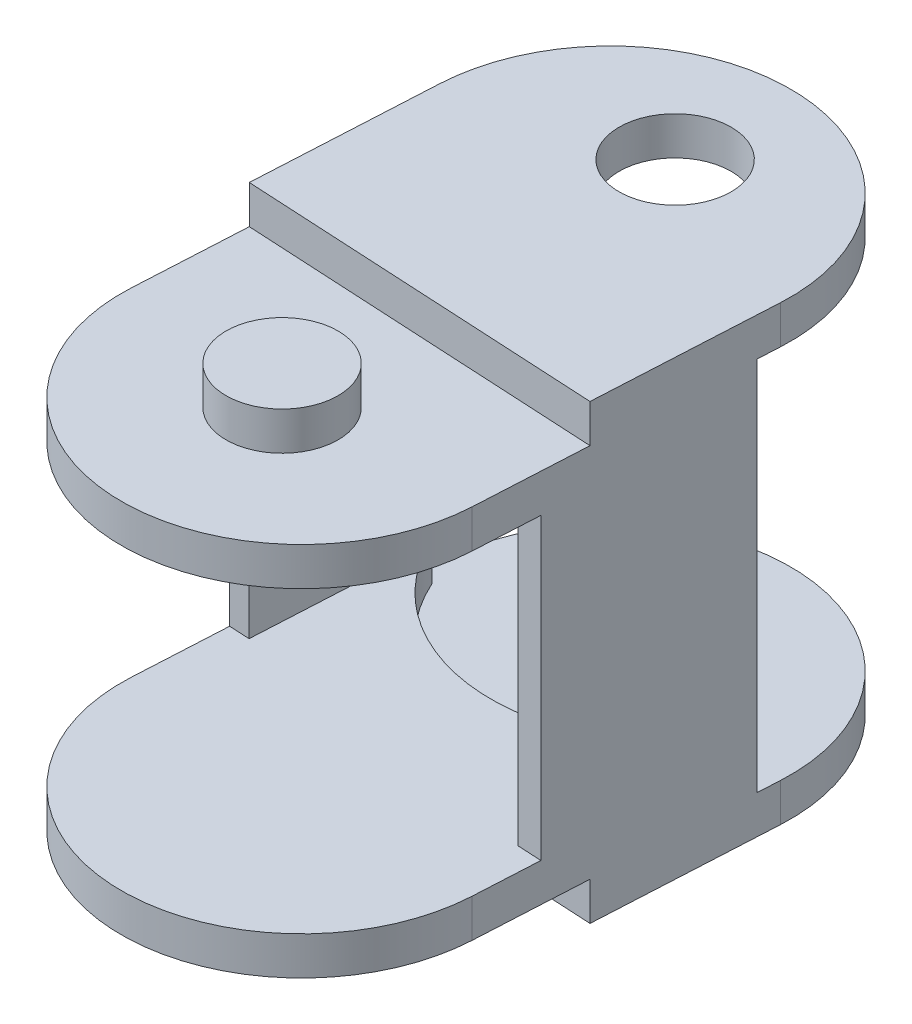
ISO-10303-21;
HEADER;
FILE_DESCRIPTION(('STEP AP214'),'2;1');
FILE_NAME('part.step','',(''),(''),'','','');
FILE_SCHEMA(('AUTOMOTIVE_DESIGN { 1 0 10303 214 1 1 1 1 }'));
ENDSEC;
DATA;
#1=APPLICATION_CONTEXT('core data for automotive mechanical design processes');
#2=APPLICATION_PROTOCOL_DEFINITION('international standard','automotive_design',2000,#1);
#3=PRODUCT_CONTEXT('',#1,'mechanical');
#4=PRODUCT('Part','Part','',(#3));
#5=PRODUCT_RELATED_PRODUCT_CATEGORY('part','',(#4));
#6=PRODUCT_DEFINITION_FORMATION('','',#4);
#7=PRODUCT_DEFINITION_CONTEXT('part definition',#1,'design');
#8=PRODUCT_DEFINITION('design','',#6,#7);
#9=PRODUCT_DEFINITION_SHAPE('','',#8);
#10=(LENGTH_UNIT() NAMED_UNIT(*) SI_UNIT(.MILLI.,.METRE.));
#11=(NAMED_UNIT(*) PLANE_ANGLE_UNIT() SI_UNIT($,.RADIAN.));
#12=(NAMED_UNIT(*) SI_UNIT($,.STERADIAN.) SOLID_ANGLE_UNIT());
#13=UNCERTAINTY_MEASURE_WITH_UNIT(LENGTH_MEASURE(1.E-05),#10,'distance_accuracy_value','');
#14=(GEOMETRIC_REPRESENTATION_CONTEXT(3) GLOBAL_UNCERTAINTY_ASSIGNED_CONTEXT((#13)) GLOBAL_UNIT_ASSIGNED_CONTEXT((#10,
#11,#12)) REPRESENTATION_CONTEXT('',''));
#15=CARTESIAN_POINT('',(0.,0.,0.));
#16=DIRECTION('',(0.,0.,1.));
#17=DIRECTION('',(1.,0.,0.));
#18=AXIS2_PLACEMENT_3D('',#15,#16,#17);
#19=CARTESIAN_POINT('',(-563.634774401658,6.,25.7427792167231));
#20=DIRECTION('',(0.,-1.,0.));
#21=DIRECTION('',(0.,0.,-1.));
#22=AXIS2_PLACEMENT_3D('',#19,#20,#21);
#23=PLANE('',#22);
#24=DIRECTION('',(-0.0534947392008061,0.,0.998568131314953));
#25=VECTOR('',#24,1.);
#26=CARTESIAN_POINT('',(-563.085561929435,6.,25.7722013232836));
#27=LINE('',#26,#25);
#28=CARTESIAN_POINT('',(-563.299540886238,6.,29.7664738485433));
#29=VERTEX_POINT('',#28);
#30=CARTESIAN_POINT('',(-562.871582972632,6.,21.7779287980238));
#31=VERTEX_POINT('',#30);
#32=EDGE_CURVE('E313',#29,#31,#27,.F.);
#33=ORIENTED_EDGE('',*,*,#32,.T.);
#34=DIRECTION('',(0.998568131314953,0.,0.0534947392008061));
#35=VECTOR('',#34,1.);
#36=CARTESIAN_POINT('',(-563.420795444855,6.,21.7485066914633));
#37=LINE('',#36,#35);
#38=CARTESIAN_POINT('',(-563.970007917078,6.,21.7190845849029));
#39=VERTEX_POINT('',#38);
#40=EDGE_CURVE('E291',#31,#39,#37,.F.);
#41=ORIENTED_EDGE('',*,*,#40,.T.);
#42=DIRECTION('',(-0.0534947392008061,0.,0.998568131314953));
#43=VECTOR('',#42,1.);
#44=CARTESIAN_POINT('',(-564.245505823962,6.,26.8617104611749));
#45=LINE('',#44,#43);
#46=CARTESIAN_POINT('',(-564.397965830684,6.,29.7076296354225));
#47=VERTEX_POINT('',#46);
#48=EDGE_CURVE('E238',#47,#39,#45,.F.);
#49=ORIENTED_EDGE('',*,*,#48,.F.);
#50=DIRECTION('',(-0.998568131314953,0.,-0.0534947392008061));
#51=VECTOR('',#50,1.);
#52=CARTESIAN_POINT('',(-563.848753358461,6.,29.7370517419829));
#53=LINE('',#52,#51);
#54=EDGE_CURVE('E262',#47,#29,#53,.F.);
#55=ORIENTED_EDGE('',*,*,#54,.T.);
#56=EDGE_LOOP('',(#33,#41,#49,#55));
#57=FACE_BOUND('',#56,.T.);
#58=ADVANCED_FACE('F17',(#57),#23,.F.);
#59=CARTESIAN_POINT('',(-563.420795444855,8.,21.7485066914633));
#60=DIRECTION('',(-0.0534947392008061,0.,0.998568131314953));
#61=DIRECTION('',(0.998568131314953,0.,0.0534947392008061));
#62=AXIS2_PLACEMENT_3D('',#59,#60,#61);
#63=PLANE('',#62);
#64=DIRECTION('',(0.,1.,0.));
#65=VECTOR('',#64,1.);
#66=CARTESIAN_POINT('',(-562.871582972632,8.,21.7779287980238));
#67=LINE('',#66,#65);
#68=CARTESIAN_POINT('',(-562.871582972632,0.,21.7779287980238));
#69=VERTEX_POINT('',#68);
#70=EDGE_CURVE('E314',#31,#69,#67,.F.);
#71=ORIENTED_EDGE('',*,*,#70,.T.);
#72=DIRECTION('',(0.998568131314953,0.,0.0534947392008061));
#73=VECTOR('',#72,1.);
#74=CARTESIAN_POINT('',(-563.420795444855,0.,21.7485066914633));
#75=LINE('',#74,#73);
#76=CARTESIAN_POINT('',(-563.970007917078,0.,21.7190845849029));
#77=VERTEX_POINT('',#76);
#78=EDGE_CURVE('E301',#77,#69,#75,.T.);
#79=ORIENTED_EDGE('',*,*,#78,.F.);
#80=DIRECTION('',(0.,1.,0.));
#81=VECTOR('',#80,1.);
#82=CARTESIAN_POINT('',(-563.970007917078,20.1,21.7190845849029));
#83=LINE('',#82,#81);
#84=EDGE_CURVE('E282',#39,#77,#83,.F.);
#85=ORIENTED_EDGE('',*,*,#84,.F.);
#86=ORIENTED_EDGE('',*,*,#40,.F.);
#87=EDGE_LOOP('',(#71,#79,#85,#86));
#88=FACE_BOUND('',#87,.T.);
#89=ADVANCED_FACE('F925',(#88),#63,.F.);
#90=CARTESIAN_POINT('',(-554.253583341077,8.,20.7374566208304));
#91=DIRECTION('',(0.0534947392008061,0.,-0.998568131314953));
#92=DIRECTION('',(-0.998568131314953,0.,-0.0534947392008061));
#93=AXIS2_PLACEMENT_3D('',#90,#91,#92);
#94=PLANE('',#93);
#95=DIRECTION('',(0.,1.,0.));
#96=VECTOR('',#95,1.);
#97=CARTESIAN_POINT('',(-563.889765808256,20.1,20.2212323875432));
#98=LINE('',#97,#96);
#99=CARTESIAN_POINT('',(-563.889765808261,0.,20.221232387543));
#100=VERTEX_POINT('',#99);
#101=CARTESIAN_POINT('',(-563.889765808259,-2.05,20.2212323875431));
#102=VERTEX_POINT('',#101);
#103=EDGE_CURVE('E269',#100,#102,#98,.F.);
#104=ORIENTED_EDGE('',*,*,#103,.F.);
#105=DIRECTION('',(-0.998568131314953,0.,-0.0534947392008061));
#106=VECTOR('',#105,1.);
#107=CARTESIAN_POINT('',(-554.253583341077,0.,20.7374566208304));
#108=LINE('',#107,#106);
#109=CARTESIAN_POINT('',(-563.003029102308,0.,20.2687361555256));
#110=VERTEX_POINT('',#109);
#111=EDGE_CURVE('E274',#100,#110,#108,.F.);
#112=ORIENTED_EDGE('',*,*,#111,.T.);
#113=DIRECTION('',(0.,-1.,0.));
#114=VECTOR('',#113,1.);
#115=CARTESIAN_POINT('',(-563.003029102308,-1.025,20.2687361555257));
#116=LINE('',#115,#114);
#117=CARTESIAN_POINT('',(-563.003029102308,-2.05,20.2687361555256));
#118=VERTEX_POINT('',#117);
#119=EDGE_CURVE('E239',#110,#118,#116,.T.);
#120=ORIENTED_EDGE('',*,*,#119,.T.);
#121=DIRECTION('',(-0.998568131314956,0.,-0.0534947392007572));
#122=VECTOR('',#121,1.);
#123=CARTESIAN_POINT('',(-563.003029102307,-2.05,20.2687361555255));
#124=LINE('',#123,#122);
#125=EDGE_CURVE('E227',#118,#102,#124,.T.);
#126=ORIENTED_EDGE('',*,*,#125,.T.);
#127=EDGE_LOOP('',(#104,#112,#120,#126));
#128=FACE_BOUND('',#127,.T.);
#129=ADVANCED_FACE('F916',(#128),#94,.T.);
#130=CARTESIAN_POINT('',(-563.848753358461,8.,29.7370517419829));
#131=DIRECTION('',(0.0534947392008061,0.,-0.998568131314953));
#132=DIRECTION('',(-0.998568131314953,0.,-0.0534947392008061));
#133=AXIS2_PLACEMENT_3D('',#130,#131,#132);
#134=PLANE('',#133);
#135=DIRECTION('',(0.,1.,0.));
#136=VECTOR('',#135,1.);
#137=CARTESIAN_POINT('',(-564.397965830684,20.1,29.7076296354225));
#138=LINE('',#137,#136);
#139=CARTESIAN_POINT('',(-564.397965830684,0.,29.7076296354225));
#140=VERTEX_POINT('',#139);
#141=EDGE_CURVE('E268',#140,#47,#138,.T.);
#142=ORIENTED_EDGE('',*,*,#141,.F.);
#143=DIRECTION('',(-0.998568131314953,0.,-0.0534947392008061));
#144=VECTOR('',#143,1.);
#145=CARTESIAN_POINT('',(-563.848753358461,0.,29.7370517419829));
#146=LINE('',#145,#144);
#147=CARTESIAN_POINT('',(-563.299540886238,0.,29.7664738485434));
#148=VERTEX_POINT('',#147);
#149=EDGE_CURVE('E272',#148,#140,#146,.T.);
#150=ORIENTED_EDGE('',*,*,#149,.F.);
#151=DIRECTION('',(0.,1.,0.));
#152=VECTOR('',#151,1.);
#153=CARTESIAN_POINT('',(-563.299540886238,8.,29.7664738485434));
#154=LINE('',#153,#152);
#155=EDGE_CURVE('E310',#148,#29,#154,.T.);
#156=ORIENTED_EDGE('',*,*,#155,.T.);
#157=ORIENTED_EDGE('',*,*,#54,.F.);
#158=EDGE_LOOP('',(#142,#150,#156,#157));
#159=FACE_BOUND('',#158,.T.);
#160=ADVANCED_FACE('F907',(#159),#134,.F.);
#161=CARTESIAN_POINT('',(-555.0827517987,-4.1,36.2152626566));
#162=DIRECTION('',(0.,-1.,0.));
#163=DIRECTION('',(0.,0.,-1.));
#164=AXIS2_PLACEMENT_3D('',#161,#162,#163);
#165=PLANE('',#164);
#166=CARTESIAN_POINT('',(-555.0827517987,-4.1,36.2152626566));
#167=DIRECTION('',(0.,-1.,0.));
#168=DIRECTION('',(0.,0.,-1.));
#169=AXIS2_PLACEMENT_3D('',#166,#167,#168);
#170=CIRCLE('',#169,3.);
#171=CARTESIAN_POINT('',(-555.0827517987,-4.1,33.2152626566));
#172=VERTEX_POINT('',#171);
#173=EDGE_CURVE('E395',#172,#172,#170,.F.);
#174=ORIENTED_EDGE('',*,*,#173,.F.);
#175=EDGE_LOOP('',(#174));
#176=FACE_BOUND('',#175,.T.);
#177=ADVANCED_FACE('F898',(#176),#165,.T.);
#178=CARTESIAN_POINT('',(-555.0827517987,20.1,36.2152626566));
#179=DIRECTION('',(0.,1.,0.));
#180=DIRECTION('',(0.,0.,1.));
#181=AXIS2_PLACEMENT_3D('',#178,#179,#180);
#182=PLANE('',#181);
#183=CARTESIAN_POINT('',(-555.0827517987,20.1,36.2152626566));
#184=DIRECTION('',(0.,-1.,0.));
#185=DIRECTION('',(0.,0.,-1.));
#186=AXIS2_PLACEMENT_3D('',#183,#184,#185);
#187=CIRCLE('',#186,3.);
#188=CARTESIAN_POINT('',(-555.0827517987,20.1,33.2152626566));
#189=VERTEX_POINT('',#188);
#190=EDGE_CURVE('E391',#189,#189,#187,.T.);
#191=ORIENTED_EDGE('',*,*,#190,.F.);
#192=EDGE_LOOP('',(#191));
#193=FACE_BOUND('',#192,.T.);
#194=ADVANCED_FACE('F889',(#193),#182,.T.);
#195=CARTESIAN_POINT('',(-554.012857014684,-3.075,16.2439000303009));
#196=DIRECTION('',(0.,-1.,0.));
#197=DIRECTION('',(0.,0.,-1.));
#198=AXIS2_PLACEMENT_3D('',#195,#196,#197);
#199=CYLINDRICAL_SURFACE('',#198,3.);
#200=CARTESIAN_POINT('',(-554.012857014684,-4.1,16.2439000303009));
#201=DIRECTION('',(0.,-1.,0.));
#202=DIRECTION('',(0.,0.,-1.));
#203=AXIS2_PLACEMENT_3D('',#200,#201,#202);
#204=CIRCLE('',#203,3.);
#205=CARTESIAN_POINT('',(-554.012857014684,-4.1,13.2439000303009));
#206=VERTEX_POINT('',#205);
#207=EDGE_CURVE('E381',#206,#206,#204,.F.);
#208=ORIENTED_EDGE('',*,*,#207,.F.);
#209=EDGE_LOOP('',(#208));
#210=FACE_BOUND('',#209,.T.);
#211=CARTESIAN_POINT('',(-554.012857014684,-2.05,16.2439000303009));
#212=DIRECTION('',(0.,-1.,0.));
#213=DIRECTION('',(0.,0.,-1.));
#214=AXIS2_PLACEMENT_3D('',#211,#212,#213);
#215=CIRCLE('',#214,3.);
#216=CARTESIAN_POINT('',(-554.012857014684,-2.05,13.2439000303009));
#217=VERTEX_POINT('',#216);
#218=EDGE_CURVE('E20',#217,#217,#215,.F.);
#219=ORIENTED_EDGE('',*,*,#218,.T.);
#220=EDGE_LOOP('',(#219));
#221=FACE_BOUND('',#220,.T.);
#222=ADVANCED_FACE('F880',(#210,#221),#199,.F.);
#223=CARTESIAN_POINT('',(-553.718635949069,-2.05,10.7517753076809));
#224=DIRECTION('',(0.,-1.,0.));
#225=DIRECTION('',(0.,0.,-1.));
#226=AXIS2_PLACEMENT_3D('',#223,#224,#225);
#227=PLANE('',#226);
#228=ORIENTED_EDGE('',*,*,#218,.F.);
#229=EDGE_LOOP('',(#228));
#230=FACE_BOUND('',#229,.T.);
#231=DIRECTION('',(-0.0534947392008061,0.,0.998568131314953));
#232=VECTOR('',#231,1.);
#233=CARTESIAN_POINT('',(-564.245505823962,-2.05,26.8617104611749));
#234=LINE('',#233,#232);
#235=CARTESIAN_POINT('',(-563.825572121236,-2.05,19.0229506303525));
#236=VERTEX_POINT('',#235);
#237=EDGE_CURVE('E265',#102,#236,#234,.F.);
#238=ORIENTED_EDGE('',*,*,#237,.F.);
#239=ORIENTED_EDGE('',*,*,#125,.F.);
#240=CARTESIAN_POINT('',(-554.012857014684,-2.05,16.2439000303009));
#241=DIRECTION('',(0.,-1.,0.));
#242=DIRECTION('',(0.,0.,-1.));
#243=AXIS2_PLACEMENT_3D('',#240,#241,#242);
#244=CIRCLE('',#243,9.85);
#245=CARTESIAN_POINT('',(-545.504137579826,-2.05,21.2061770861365));
#246=VERTEX_POINT('',#245);
#247=EDGE_CURVE('E232',#118,#246,#244,.F.);
#248=ORIENTED_EDGE('',*,*,#247,.T.);
#249=DIRECTION('',(-0.998568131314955,0.,-0.0534947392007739));
#250=VECTOR('',#249,1.);
#251=CARTESIAN_POINT('',(-544.617400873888,-2.05,21.2536808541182));
#252=LINE('',#251,#250);
#253=CARTESIAN_POINT('',(-544.617400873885,-2.05,21.2536808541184));
#254=VERTEX_POINT('',#253);
#255=EDGE_CURVE('E217',#254,#246,#252,.T.);
#256=ORIENTED_EDGE('',*,*,#255,.F.);
#257=DIRECTION('',(-0.0534947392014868,0.,0.998568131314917));
#258=VECTOR('',#257,1.);
#259=CARTESIAN_POINT('',(-544.553207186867,-2.05,20.0553990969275));
#260=LINE('',#259,#258);
#261=CARTESIAN_POINT('',(-544.553207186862,-2.05,20.0553990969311));
#262=VERTEX_POINT('',#261);
#263=EDGE_CURVE('E228',#262,#254,#260,.T.);
#264=ORIENTED_EDGE('',*,*,#263,.F.);
#265=CARTESIAN_POINT('',(-554.189389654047,-2.05,19.5391748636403));
#266=DIRECTION('',(0.,-1.,0.));
#267=DIRECTION('',(0.,0.,-1.));
#268=AXIS2_PLACEMENT_3D('',#265,#266,#267);
#269=CIRCLE('',#268,9.65000000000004);
#270=EDGE_CURVE('E378',#236,#262,#269,.T.);
#271=ORIENTED_EDGE('',*,*,#270,.F.);
#272=EDGE_LOOP('',(#238,#239,#248,#256,#264,#271));
#273=FACE_BOUND('',#272,.T.);
#274=ADVANCED_FACE('F234',(#230,#273),#227,.F.);
#275=CARTESIAN_POINT('',(-563.085561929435,8.,25.7722013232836));
#276=DIRECTION('',(-0.998568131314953,0.,-0.0534947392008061));
#277=DIRECTION('',(-0.0534947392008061,0.,0.998568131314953));
#278=AXIS2_PLACEMENT_3D('',#275,#276,#277);
#279=PLANE('',#278);
#280=ORIENTED_EDGE('',*,*,#155,.F.);
#281=DIRECTION('',(0.0534947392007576,0.,-0.998568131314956));
#282=VECTOR('',#281,1.);
#283=CARTESIAN_POINT('',(-563.299540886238,0.,29.7664738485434));
#284=LINE('',#283,#282);
#285=EDGE_CURVE('E298',#148,#69,#284,.T.);
#286=ORIENTED_EDGE('',*,*,#285,.T.);
#287=ORIENTED_EDGE('',*,*,#70,.F.);
#288=ORIENTED_EDGE('',*,*,#32,.F.);
#289=EDGE_LOOP('',(#280,#286,#287,#288));
#290=FACE_BOUND('',#289,.T.);
#291=ADVANCED_FACE('F864',(#290),#279,.F.);
#292=CARTESIAN_POINT('',(-554.012857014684,-1.025,16.2439000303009));
#293=DIRECTION('',(0.,-1.,0.));
#294=DIRECTION('',(0.,0.,-1.));
#295=AXIS2_PLACEMENT_3D('',#292,#293,#294);
#296=CYLINDRICAL_SURFACE('',#295,9.85);
#297=CARTESIAN_POINT('',(-554.012857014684,0.,16.2439000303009));
#298=DIRECTION('',(0.,-1.,0.));
#299=DIRECTION('',(0.,0.,-1.));
#300=AXIS2_PLACEMENT_3D('',#297,#298,#299);
#301=CIRCLE('',#300,9.85);
#302=CARTESIAN_POINT('',(-545.944128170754,0.,21.8935119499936));
#303=VERTEX_POINT('',#302);
#304=EDGE_CURVE('E297',#110,#303,#301,.F.);
#305=ORIENTED_EDGE('',*,*,#304,.T.);
#306=CARTESIAN_POINT('',(-554.012857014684,0.,16.2439000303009));
#307=DIRECTION('',(0.,-1.,0.));
#308=DIRECTION('',(0.,0.,-1.));
#309=AXIS2_PLACEMENT_3D('',#306,#307,#308);
#310=CIRCLE('',#309,9.85);
#311=CARTESIAN_POINT('',(-545.504137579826,0.,21.2061770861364));
#312=VERTEX_POINT('',#311);
#313=EDGE_CURVE('E242',#303,#312,#310,.F.);
#314=ORIENTED_EDGE('',*,*,#313,.T.);
#315=DIRECTION('',(0.,1.,0.));
#316=VECTOR('',#315,1.);
#317=CARTESIAN_POINT('',(-545.504137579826,8.,21.2061770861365));
#318=LINE('',#317,#316);
#319=EDGE_CURVE('E222',#246,#312,#318,.T.);
#320=ORIENTED_EDGE('',*,*,#319,.F.);
#321=ORIENTED_EDGE('',*,*,#247,.F.);
#322=ORIENTED_EDGE('',*,*,#119,.F.);
#323=EDGE_LOOP('',(#305,#314,#320,#321,#322));
#324=FACE_BOUND('',#323,.T.);
#325=ADVANCED_FACE('F240',(#324),#296,.F.);
#326=CARTESIAN_POINT('',(-564.245505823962,20.1,26.8617104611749));
#327=DIRECTION('',(-0.998568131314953,0.,-0.0534947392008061));
#328=DIRECTION('',(-0.0534947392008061,0.,0.998568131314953));
#329=AXIS2_PLACEMENT_3D('',#326,#327,#328);
#330=PLANE('',#329);
#331=DIRECTION('',(0.0534947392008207,0.,-0.998568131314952));
#332=VECTOR('',#331,1.);
#333=CARTESIAN_POINT('',(-564.665439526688,0.,34.7004702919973));
#334=LINE('',#333,#332);
#335=CARTESIAN_POINT('',(-564.665439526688,0.,34.7004702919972));
#336=VERTEX_POINT('',#335);
#337=EDGE_CURVE('E323',#336,#140,#334,.T.);
#338=ORIENTED_EDGE('',*,*,#337,.T.);
#339=ORIENTED_EDGE('',*,*,#141,.T.);
#340=ORIENTED_EDGE('',*,*,#48,.T.);
#341=ORIENTED_EDGE('',*,*,#84,.T.);
#342=DIRECTION('',(0.0534947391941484,0.,-0.99856813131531));
#343=VECTOR('',#342,1.);
#344=CARTESIAN_POINT('',(-563.970007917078,0.,21.7190845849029));
#345=LINE('',#344,#343);
#346=EDGE_CURVE('E294',#77,#100,#345,.T.);
#347=ORIENTED_EDGE('',*,*,#346,.T.);
#348=ORIENTED_EDGE('',*,*,#103,.T.);
#349=ORIENTED_EDGE('',*,*,#237,.T.);
#350=DIRECTION('',(0.,-1.,0.));
#351=VECTOR('',#350,1.);
#352=CARTESIAN_POINT('',(-563.825572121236,20.1,19.0229506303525));
#353=LINE('',#352,#351);
#354=CARTESIAN_POINT('',(-563.825572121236,-4.1,19.0229506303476));
#355=VERTEX_POINT('',#354);
#356=EDGE_CURVE('E245',#355,#236,#353,.F.);
#357=ORIENTED_EDGE('',*,*,#356,.F.);
#358=DIRECTION('',(0.0534947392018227,0.,-0.998568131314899));
#359=VECTOR('',#358,1.);
#360=CARTESIAN_POINT('',(-564.344471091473,-4.1,28.7090615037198));
#361=LINE('',#360,#359);
#362=CARTESIAN_POINT('',(-564.344471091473,-4.1,28.7090615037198));
#363=VERTEX_POINT('',#362);
#364=EDGE_CURVE('E384',#363,#355,#361,.T.);
#365=ORIENTED_EDGE('',*,*,#364,.F.);
#366=DIRECTION('',(0.,1.,0.));
#367=VECTOR('',#366,1.);
#368=CARTESIAN_POINT('',(-564.344471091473,-3.075,28.7090615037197));
#369=LINE('',#368,#367);
#370=CARTESIAN_POINT('',(-564.344471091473,-2.05,28.7090615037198));
#371=VERTEX_POINT('',#370);
#372=EDGE_CURVE('E386',#371,#363,#369,.F.);
#373=ORIENTED_EDGE('',*,*,#372,.F.);
#374=DIRECTION('',(0.0534947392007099,0.,-0.998568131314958));
#375=VECTOR('',#374,1.);
#376=CARTESIAN_POINT('',(-564.665439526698,-2.05,34.7004702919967));
#377=LINE('',#376,#375);
#378=CARTESIAN_POINT('',(-564.665439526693,-2.05,34.7004702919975));
#379=VERTEX_POINT('',#378);
#380=EDGE_CURVE('E370',#379,#371,#377,.T.);
#381=ORIENTED_EDGE('',*,*,#380,.F.);
#382=DIRECTION('',(0.,-1.,0.));
#383=VECTOR('',#382,1.);
#384=CARTESIAN_POINT('',(-564.665439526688,20.1,34.7004702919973));
#385=LINE('',#384,#383);
#386=EDGE_CURVE('E371',#336,#379,#385,.T.);
#387=ORIENTED_EDGE('',*,*,#386,.F.);
#388=EDGE_LOOP('',(#338,#339,#340,#341,#347,#348,#349,#357,#365,#373,#381,#387));
#389=FACE_BOUND('',#388,.T.);
#390=ADVANCED_FACE('F510',(#389),#330,.T.);
#391=CARTESIAN_POINT('',(-555.0827517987,-3.075,36.2152626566));
#392=DIRECTION('',(0.,-1.,0.));
#393=DIRECTION('',(0.,0.,-1.));
#394=AXIS2_PLACEMENT_3D('',#391,#392,#393);
#395=CYLINDRICAL_SURFACE('',#394,3.);
#396=CARTESIAN_POINT('',(-555.0827517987,-2.05,36.2152626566));
#397=DIRECTION('',(0.,-1.,0.));
#398=DIRECTION('',(0.,0.,-1.));
#399=AXIS2_PLACEMENT_3D('',#396,#397,#398);
#400=CIRCLE('',#399,3.);
#401=CARTESIAN_POINT('',(-555.0827517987,-2.05,33.2152626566));
#402=VERTEX_POINT('',#401);
#403=EDGE_CURVE('E363',#402,#402,#400,.F.);
#404=ORIENTED_EDGE('',*,*,#403,.F.);
#405=EDGE_LOOP('',(#404));
#406=FACE_BOUND('',#405,.T.);
#407=ORIENTED_EDGE('',*,*,#173,.T.);
#408=EDGE_LOOP('',(#407));
#409=FACE_BOUND('',#408,.T.);
#410=ADVANCED_FACE('F840',(#406,#409),#395,.T.);
#411=CARTESIAN_POINT('',(-555.0827517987,19.075,36.2152626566));
#412=DIRECTION('',(0.,-1.,0.));
#413=DIRECTION('',(0.,0.,-1.));
#414=AXIS2_PLACEMENT_3D('',#411,#412,#413);
#415=CYLINDRICAL_SURFACE('',#414,3.);
#416=ORIENTED_EDGE('',*,*,#190,.T.);
#417=EDGE_LOOP('',(#416));
#418=FACE_BOUND('',#417,.T.);
#419=CARTESIAN_POINT('',(-555.0827517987,18.05,36.2152626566));
#420=DIRECTION('',(0.,-1.,0.));
#421=DIRECTION('',(0.,0.,-1.));
#422=AXIS2_PLACEMENT_3D('',#419,#420,#421);
#423=CIRCLE('',#422,3.);
#424=CARTESIAN_POINT('',(-555.0827517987,18.05,33.2152626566));
#425=VERTEX_POINT('',#424);
#426=EDGE_CURVE('E359',#425,#425,#423,.F.);
#427=ORIENTED_EDGE('',*,*,#426,.T.);
#428=EDGE_LOOP('',(#427));
#429=FACE_BOUND('',#428,.T.);
#430=ADVANCED_FACE('F831',(#418,#429),#415,.T.);
#431=CARTESIAN_POINT('',(-554.012857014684,19.075,16.2439000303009));
#432=DIRECTION('',(0.,-1.,0.));
#433=DIRECTION('',(0.,0.,-1.));
#434=AXIS2_PLACEMENT_3D('',#431,#432,#433);
#435=CYLINDRICAL_SURFACE('',#434,3.);
#436=CARTESIAN_POINT('',(-554.012857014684,18.05,16.2439000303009));
#437=DIRECTION('',(0.,-1.,0.));
#438=DIRECTION('',(0.,0.,-1.));
#439=AXIS2_PLACEMENT_3D('',#436,#437,#438);
#440=CIRCLE('',#439,3.);
#441=CARTESIAN_POINT('',(-554.012857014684,18.05,13.2439000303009));
#442=VERTEX_POINT('',#441);
#443=EDGE_CURVE('E387',#442,#442,#440,.F.);
#444=ORIENTED_EDGE('',*,*,#443,.F.);
#445=EDGE_LOOP('',(#444));
#446=FACE_BOUND('',#445,.T.);
#447=CARTESIAN_POINT('',(-554.012857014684,20.1,16.2439000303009));
#448=DIRECTION('',(0.,-1.,0.));
#449=DIRECTION('',(0.,0.,-1.));
#450=AXIS2_PLACEMENT_3D('',#447,#448,#449);
#451=CIRCLE('',#450,3.);
#452=CARTESIAN_POINT('',(-554.012857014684,20.1,13.2439000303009));
#453=VERTEX_POINT('',#452);
#454=EDGE_CURVE('E355',#453,#453,#451,.F.);
#455=ORIENTED_EDGE('',*,*,#454,.T.);
#456=EDGE_LOOP('',(#455));
#457=FACE_BOUND('',#456,.T.);
#458=ADVANCED_FACE('F822',(#446,#457),#435,.F.);
#459=CARTESIAN_POINT('',(-553.718635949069,18.05,10.7517753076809));
#460=DIRECTION('',(0.,-1.,0.));
#461=DIRECTION('',(0.,0.,-1.));
#462=AXIS2_PLACEMENT_3D('',#459,#460,#461);
#463=PLANE('',#462);
#464=ORIENTED_EDGE('',*,*,#443,.T.);
#465=EDGE_LOOP('',(#464));
#466=FACE_BOUND('',#465,.T.);
#467=DIRECTION('',(-0.998568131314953,0.,-0.0534947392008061));
#468=VECTOR('',#467,1.);
#469=CARTESIAN_POINT('',(-554.253583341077,18.05,20.7374566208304));
#470=LINE('',#469,#468);
#471=CARTESIAN_POINT('',(-563.889765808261,18.05,20.221232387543));
#472=VERTEX_POINT('',#471);
#473=CARTESIAN_POINT('',(-563.003029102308,18.05,20.2687361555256));
#474=VERTEX_POINT('',#473);
#475=EDGE_CURVE('E466',#472,#474,#470,.F.);
#476=ORIENTED_EDGE('',*,*,#475,.F.);
#477=DIRECTION('',(0.0534947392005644,0.,-0.998568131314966));
#478=VECTOR('',#477,1.);
#479=CARTESIAN_POINT('',(-563.889765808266,18.05,20.2212323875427));
#480=LINE('',#479,#478);
#481=CARTESIAN_POINT('',(-563.825572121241,18.05,19.0229506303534));
#482=VERTEX_POINT('',#481);
#483=EDGE_CURVE('E390',#472,#482,#480,.T.);
#484=ORIENTED_EDGE('',*,*,#483,.T.);
#485=CARTESIAN_POINT('',(-554.189389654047,18.05,19.5391748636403));
#486=DIRECTION('',(0.,-1.,0.));
#487=DIRECTION('',(0.,0.,-1.));
#488=AXIS2_PLACEMENT_3D('',#485,#486,#487);
#489=CIRCLE('',#488,9.65000000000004);
#490=CARTESIAN_POINT('',(-544.55320718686,18.05,20.0553990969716));
#491=VERTEX_POINT('',#490);
#492=EDGE_CURVE('E352',#491,#482,#489,.F.);
#493=ORIENTED_EDGE('',*,*,#492,.F.);
#494=DIRECTION('',(-0.0534947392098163,0.,0.998568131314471));
#495=VECTOR('',#494,1.);
#496=CARTESIAN_POINT('',(-544.553207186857,18.05,20.0553990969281));
#497=LINE('',#496,#495);
#498=CARTESIAN_POINT('',(-544.617400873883,18.05,21.2536808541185));
#499=VERTEX_POINT('',#498);
#500=EDGE_CURVE('E394',#491,#499,#497,.T.);
#501=ORIENTED_EDGE('',*,*,#500,.T.);
#502=DIRECTION('',(-0.998568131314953,0.,-0.0534947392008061));
#503=VECTOR('',#502,1.);
#504=CARTESIAN_POINT('',(-554.253583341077,18.05,20.7374566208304));
#505=LINE('',#504,#503);
#506=CARTESIAN_POINT('',(-545.504137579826,18.05,21.2061770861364));
#507=VERTEX_POINT('',#506);
#508=EDGE_CURVE('E445',#507,#499,#505,.F.);
#509=ORIENTED_EDGE('',*,*,#508,.F.);
#510=CARTESIAN_POINT('',(-554.012857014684,18.05,16.2439000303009));
#511=DIRECTION('',(0.,-1.,0.));
#512=DIRECTION('',(0.,0.,-1.));
#513=AXIS2_PLACEMENT_3D('',#510,#511,#512);
#514=CIRCLE('',#513,9.85);
#515=EDGE_CURVE('E342',#507,#474,#514,.T.);
#516=ORIENTED_EDGE('',*,*,#515,.T.);
#517=EDGE_LOOP('',(#476,#484,#493,#501,#509,#516));
#518=FACE_BOUND('',#517,.T.);
#519=ADVANCED_FACE('F813',(#466,#518),#463,.T.);
#520=CARTESIAN_POINT('',(-554.012857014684,0.,16.2439000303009));
#521=DIRECTION('',(0.,1.,0.));
#522=DIRECTION('',(0.,0.,1.));
#523=AXIS2_PLACEMENT_3D('',#520,#521,#522);
#524=PLANE('',#523);
#525=ORIENTED_EDGE('',*,*,#313,.F.);
#526=DIRECTION('',(0.0534947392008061,0.,-0.998568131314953));
#527=VECTOR('',#526,1.);
#528=CARTESIAN_POINT('',(-546.200373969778,0.,26.6767652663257));
#529=LINE('',#528,#527);
#530=CARTESIAN_POINT('',(-545.906152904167,0.,21.1846405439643));
#531=VERTEX_POINT('',#530);
#532=EDGE_CURVE('E434',#303,#531,#529,.T.);
#533=ORIENTED_EDGE('',*,*,#532,.T.);
#534=DIRECTION('',(-0.998568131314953,0.,-0.0534947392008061));
#535=VECTOR('',#534,1.);
#536=CARTESIAN_POINT('',(-554.253583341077,0.,20.7374566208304));
#537=LINE('',#536,#535);
#538=EDGE_CURVE('E244',#312,#531,#537,.T.);
#539=ORIENTED_EDGE('',*,*,#538,.F.);
#540=EDGE_LOOP('',(#525,#533,#539));
#541=FACE_BOUND('',#540,.T.);
#542=ADVANCED_FACE('F581',(#541),#524,.F.);
#543=CARTESIAN_POINT('',(-554.012857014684,16.,16.2439000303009));
#544=DIRECTION('',(0.,-1.,0.));
#545=DIRECTION('',(0.,0.,-1.));
#546=AXIS2_PLACEMENT_3D('',#543,#544,#545);
#547=PLANE('',#546);
#548=CARTESIAN_POINT('',(-554.012857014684,16.,16.2439000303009));
#549=DIRECTION('',(0.,-1.,0.));
#550=DIRECTION('',(0.,0.,-1.));
#551=AXIS2_PLACEMENT_3D('',#548,#549,#550);
#552=CIRCLE('',#551,9.85);
#553=CARTESIAN_POINT('',(-545.944128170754,16.,21.8935119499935));
#554=VERTEX_POINT('',#553);
#555=CARTESIAN_POINT('',(-545.504137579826,16.,21.2061770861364));
#556=VERTEX_POINT('',#555);
#557=EDGE_CURVE('E346',#554,#556,#552,.F.);
#558=ORIENTED_EDGE('',*,*,#557,.T.);
#559=DIRECTION('',(-0.998568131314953,0.,-0.0534947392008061));
#560=VECTOR('',#559,1.);
#561=CARTESIAN_POINT('',(-554.253583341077,16.,20.7374566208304));
#562=LINE('',#561,#560);
#563=CARTESIAN_POINT('',(-545.906152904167,16.,21.1846405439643));
#564=VERTEX_POINT('',#563);
#565=EDGE_CURVE('E247',#564,#556,#562,.F.);
#566=ORIENTED_EDGE('',*,*,#565,.F.);
#567=DIRECTION('',(0.0534947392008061,0.,-0.998568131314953));
#568=VECTOR('',#567,1.);
#569=CARTESIAN_POINT('',(-546.200373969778,16.,26.6767652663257));
#570=LINE('',#569,#568);
#571=EDGE_CURVE('E440',#564,#554,#570,.F.);
#572=ORIENTED_EDGE('',*,*,#571,.T.);
#573=EDGE_LOOP('',(#558,#566,#572));
#574=FACE_BOUND('',#573,.T.);
#575=ADVANCED_FACE('F572',(#574),#547,.F.);
#576=CARTESIAN_POINT('',(-554.708288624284,-3.075,29.2252857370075));
#577=DIRECTION('',(-0.0534947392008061,0.,0.998568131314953));
#578=DIRECTION('',(0.998568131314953,0.,0.0534947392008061));
#579=AXIS2_PLACEMENT_3D('',#576,#577,#578);
#580=PLANE('',#579);
#581=DIRECTION('',(0.,1.,0.));
#582=VECTOR('',#581,1.);
#583=CARTESIAN_POINT('',(-545.072106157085,20.1,29.7415099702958));
#584=LINE('',#583,#582);
#585=CARTESIAN_POINT('',(-545.072106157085,-2.05,29.7415099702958));
#586=VERTEX_POINT('',#585);
#587=CARTESIAN_POINT('',(-545.072106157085,-4.1,29.7415099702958));
#588=VERTEX_POINT('',#587);
#589=EDGE_CURVE('E419',#586,#588,#584,.F.);
#590=ORIENTED_EDGE('',*,*,#589,.F.);
#591=DIRECTION('',(0.998568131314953,0.,0.0534947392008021));
#592=VECTOR('',#591,1.);
#593=CARTESIAN_POINT('',(-564.344471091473,-2.05,28.7090615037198));
#594=LINE('',#593,#592);
#595=EDGE_CURVE('E366',#371,#586,#594,.T.);
#596=ORIENTED_EDGE('',*,*,#595,.F.);
#597=ORIENTED_EDGE('',*,*,#372,.T.);
#598=DIRECTION('',(-0.998568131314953,0.,-0.0534947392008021));
#599=VECTOR('',#598,1.);
#600=CARTESIAN_POINT('',(-545.072106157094,-4.1,29.7415099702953));
#601=LINE('',#600,#599);
#602=EDGE_CURVE('E427',#588,#363,#601,.T.);
#603=ORIENTED_EDGE('',*,*,#602,.F.);
#604=EDGE_LOOP('',(#590,#596,#597,#603));
#605=FACE_BOUND('',#604,.T.);
#606=ADVANCED_FACE('F570',(#605),#580,.T.);
#607=CARTESIAN_POINT('',(-554.609323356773,-4.1,27.3779346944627));
#608=DIRECTION('',(0.,-1.,0.));
#609=DIRECTION('',(0.,0.,-1.));
#610=AXIS2_PLACEMENT_3D('',#607,#608,#609);
#611=PLANE('',#610);
#612=ORIENTED_EDGE('',*,*,#207,.T.);
#613=EDGE_LOOP('',(#612));
#614=FACE_BOUND('',#613,.T.);
#615=CARTESIAN_POINT('',(-554.189389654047,-4.1,19.5391748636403));
#616=DIRECTION('',(0.,-1.,0.));
#617=DIRECTION('',(0.,0.,-1.));
#618=AXIS2_PLACEMENT_3D('',#615,#616,#617);
#619=CIRCLE('',#618,9.65000000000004);
#620=CARTESIAN_POINT('',(-544.553207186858,-4.1,20.0553990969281));
#621=VERTEX_POINT('',#620);
#622=EDGE_CURVE('E250',#621,#355,#619,.F.);
#623=ORIENTED_EDGE('',*,*,#622,.F.);
#624=DIRECTION('',(0.0534947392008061,0.,-0.998568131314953));
#625=VECTOR('',#624,1.);
#626=CARTESIAN_POINT('',(-544.973140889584,-4.1,27.8941589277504));
#627=LINE('',#626,#625);
#628=EDGE_CURVE('E415',#588,#621,#627,.T.);
#629=ORIENTED_EDGE('',*,*,#628,.F.);
#630=ORIENTED_EDGE('',*,*,#602,.T.);
#631=ORIENTED_EDGE('',*,*,#364,.T.);
#632=EDGE_LOOP('',(#623,#629,#630,#631));
#633=FACE_BOUND('',#632,.T.);
#634=ADVANCED_FACE('F565',(#614,#633),#611,.T.);
#635=CARTESIAN_POINT('',(-554.189389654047,20.1,19.5391748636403));
#636=DIRECTION('',(0.,-1.,0.));
#637=DIRECTION('',(0.,0.,-1.));
#638=AXIS2_PLACEMENT_3D('',#635,#636,#637);
#639=CYLINDRICAL_SURFACE('',#638,9.65000000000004);
#640=ORIENTED_EDGE('',*,*,#622,.T.);
#641=ORIENTED_EDGE('',*,*,#356,.T.);
#642=ORIENTED_EDGE('',*,*,#270,.T.);
#643=DIRECTION('',(0.,1.,0.));
#644=VECTOR('',#643,1.);
#645=CARTESIAN_POINT('',(-544.553207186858,20.1,20.0553990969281));
#646=LINE('',#645,#644);
#647=EDGE_CURVE('E409',#621,#262,#646,.T.);
#648=ORIENTED_EDGE('',*,*,#647,.F.);
#649=EDGE_LOOP('',(#640,#641,#642,#648));
#650=FACE_BOUND('',#649,.T.);
#651=ADVANCED_FACE('F568',(#650),#639,.T.);
#652=CARTESIAN_POINT('',(-554.253583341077,8.,20.7374566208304));
#653=DIRECTION('',(0.0534947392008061,0.,-0.998568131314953));
#654=DIRECTION('',(-0.998568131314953,0.,-0.0534947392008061));
#655=AXIS2_PLACEMENT_3D('',#652,#653,#654);
#656=PLANE('',#655);
#657=DIRECTION('',(0.,1.,0.));
#658=VECTOR('',#657,1.);
#659=CARTESIAN_POINT('',(-544.617400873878,20.1,21.2536808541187));
#660=LINE('',#659,#658);
#661=EDGE_CURVE('E225',#254,#499,#660,.T.);
#662=ORIENTED_EDGE('',*,*,#661,.F.);
#663=ORIENTED_EDGE('',*,*,#255,.T.);
#664=ORIENTED_EDGE('',*,*,#319,.T.);
#665=ORIENTED_EDGE('',*,*,#538,.T.);
#666=DIRECTION('',(0.,1.,0.));
#667=VECTOR('',#666,1.);
#668=CARTESIAN_POINT('',(-545.906152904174,8.,21.1846405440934));
#669=LINE('',#668,#667);
#670=EDGE_CURVE('E437',#531,#564,#669,.T.);
#671=ORIENTED_EDGE('',*,*,#670,.T.);
#672=ORIENTED_EDGE('',*,*,#565,.T.);
#673=DIRECTION('',(0.,-1.,0.));
#674=VECTOR('',#673,1.);
#675=CARTESIAN_POINT('',(-545.504137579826,17.025,21.2061770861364));
#676=LINE('',#675,#674);
#677=EDGE_CURVE('E345',#556,#507,#676,.F.);
#678=ORIENTED_EDGE('',*,*,#677,.T.);
#679=ORIENTED_EDGE('',*,*,#508,.T.);
#680=EDGE_LOOP('',(#662,#663,#664,#665,#671,#672,#678,#679));
#681=FACE_BOUND('',#680,.T.);
#682=ADVANCED_FACE('F219',(#681),#656,.T.);
#683=CARTESIAN_POINT('',(-545.850219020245,8.,32.2034101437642));
#684=DIRECTION('',(0.0534947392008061,0.,-0.998568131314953));
#685=DIRECTION('',(-0.998568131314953,0.,-0.0534947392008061));
#686=AXIS2_PLACEMENT_3D('',#683,#684,#685);
#687=PLANE('',#686);
#688=DIRECTION('',(-0.998568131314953,0.,-0.0534947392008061));
#689=VECTOR('',#688,1.);
#690=CARTESIAN_POINT('',(-545.850219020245,16.,32.2034101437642));
#691=LINE('',#690,#689);
#692=CARTESIAN_POINT('',(-546.494595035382,16.,32.1688899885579));
#693=VERTEX_POINT('',#692);
#694=CARTESIAN_POINT('',(-545.205843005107,16.,32.2379302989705));
#695=VERTEX_POINT('',#694);
#696=EDGE_CURVE('E462',#693,#695,#691,.F.);
#697=ORIENTED_EDGE('',*,*,#696,.F.);
#698=DIRECTION('',(0.,1.,0.));
#699=VECTOR('',#698,1.);
#700=CARTESIAN_POINT('',(-546.494595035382,8.,32.1688899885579));
#701=LINE('',#700,#699);
#702=CARTESIAN_POINT('',(-546.494595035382,0.,32.1688899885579));
#703=VERTEX_POINT('',#702);
#704=EDGE_CURVE('E539',#693,#703,#701,.F.);
#705=ORIENTED_EDGE('',*,*,#704,.T.);
#706=DIRECTION('',(0.998568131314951,0.,0.0534947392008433));
#707=VECTOR('',#706,1.);
#708=CARTESIAN_POINT('',(-546.494595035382,0.,32.1688899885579));
#709=LINE('',#708,#707);
#710=CARTESIAN_POINT('',(-545.205843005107,0.,32.2379302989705));
#711=VERTEX_POINT('',#710);
#712=EDGE_CURVE('E545',#703,#711,#709,.T.);
#713=ORIENTED_EDGE('',*,*,#712,.T.);
#714=DIRECTION('',(0.,1.,0.));
#715=VECTOR('',#714,1.);
#716=CARTESIAN_POINT('',(-545.205843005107,20.1,32.2379302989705));
#717=LINE('',#716,#715);
#718=EDGE_CURVE('E528',#695,#711,#717,.F.);
#719=ORIENTED_EDGE('',*,*,#718,.F.);
#720=EDGE_LOOP('',(#697,#705,#713,#719));
#721=FACE_BOUND('',#720,.T.);
#722=ADVANCED_FACE('F653',(#721),#687,.F.);
#723=CARTESIAN_POINT('',(-554.547804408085,0.,26.2295813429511));
#724=DIRECTION('',(0.,-1.,0.));
#725=DIRECTION('',(0.,0.,-1.));
#726=AXIS2_PLACEMENT_3D('',#723,#724,#725);
#727=PLANE('',#726);
#728=ORIENTED_EDGE('',*,*,#304,.F.);
#729=ORIENTED_EDGE('',*,*,#111,.F.);
#730=ORIENTED_EDGE('',*,*,#346,.F.);
#731=ORIENTED_EDGE('',*,*,#78,.T.);
#732=ORIENTED_EDGE('',*,*,#285,.F.);
#733=ORIENTED_EDGE('',*,*,#149,.T.);
#734=ORIENTED_EDGE('',*,*,#337,.F.);
#735=CARTESIAN_POINT('',(-555.029257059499,0.,35.216694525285));
#736=DIRECTION('',(0.,-1.,0.));
#737=DIRECTION('',(0.,0.,-1.));
#738=AXIS2_PLACEMENT_3D('',#735,#736,#737);
#739=CIRCLE('',#738,9.65000000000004);
#740=CARTESIAN_POINT('',(-545.39307459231,0.,35.7329187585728));
#741=VERTEX_POINT('',#740);
#742=EDGE_CURVE('E372',#741,#336,#739,.T.);
#743=ORIENTED_EDGE('',*,*,#742,.F.);
#744=DIRECTION('',(0.0534947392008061,0.,-0.998568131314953));
#745=VECTOR('',#744,1.);
#746=CARTESIAN_POINT('',(-544.973140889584,0.,27.8941589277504));
#747=LINE('',#746,#745);
#748=EDGE_CURVE('E526',#711,#741,#747,.F.);
#749=ORIENTED_EDGE('',*,*,#748,.F.);
#750=ORIENTED_EDGE('',*,*,#712,.F.);
#751=DIRECTION('',(0.0534947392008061,0.,-0.998568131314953));
#752=VECTOR('',#751,1.);
#753=CARTESIAN_POINT('',(-546.200373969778,0.,26.6767652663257));
#754=LINE('',#753,#752);
#755=EDGE_CURVE('E344',#703,#303,#754,.T.);
#756=ORIENTED_EDGE('',*,*,#755,.T.);
#757=EDGE_LOOP('',(#728,#729,#730,#731,#732,#733,#734,#743,#749,#750,#756));
#758=FACE_BOUND('',#757,.T.);
#759=ADVANCED_FACE('F650',(#758),#727,.F.);
#760=CARTESIAN_POINT('',(-555.029257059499,20.1,35.216694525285));
#761=DIRECTION('',(0.,-1.,0.));
#762=DIRECTION('',(0.,0.,-1.));
#763=AXIS2_PLACEMENT_3D('',#760,#761,#762);
#764=CYLINDRICAL_SURFACE('',#763,9.65000000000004);
#765=ORIENTED_EDGE('',*,*,#742,.T.);
#766=ORIENTED_EDGE('',*,*,#386,.T.);
#767=CARTESIAN_POINT('',(-555.029257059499,-2.05,35.216694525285));
#768=DIRECTION('',(0.,-1.,0.));
#769=DIRECTION('',(0.,0.,-1.));
#770=AXIS2_PLACEMENT_3D('',#767,#768,#769);
#771=CIRCLE('',#770,9.65000000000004);
#772=CARTESIAN_POINT('',(-545.39307459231,-2.05,35.7329187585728));
#773=VERTEX_POINT('',#772);
#774=EDGE_CURVE('E367',#773,#379,#771,.T.);
#775=ORIENTED_EDGE('',*,*,#774,.F.);
#776=DIRECTION('',(0.,1.,0.));
#777=VECTOR('',#776,1.);
#778=CARTESIAN_POINT('',(-545.39307459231,20.1,35.7329187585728));
#779=LINE('',#778,#777);
#780=EDGE_CURVE('E520',#741,#773,#779,.F.);
#781=ORIENTED_EDGE('',*,*,#780,.F.);
#782=EDGE_LOOP('',(#765,#766,#775,#781));
#783=FACE_BOUND('',#782,.T.);
#784=ADVANCED_FACE('F506',(#783),#764,.T.);
#785=CARTESIAN_POINT('',(-555.15363232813,-2.05,37.5383654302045));
#786=DIRECTION('',(0.,-1.,0.));
#787=DIRECTION('',(0.,0.,-1.));
#788=AXIS2_PLACEMENT_3D('',#785,#786,#787);
#789=PLANE('',#788);
#790=ORIENTED_EDGE('',*,*,#403,.T.);
#791=EDGE_LOOP('',(#790));
#792=FACE_BOUND('',#791,.T.);
#793=ORIENTED_EDGE('',*,*,#595,.T.);
#794=DIRECTION('',(0.0534947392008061,0.,-0.998568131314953));
#795=VECTOR('',#794,1.);
#796=CARTESIAN_POINT('',(-544.973140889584,-2.05,27.8941589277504));
#797=LINE('',#796,#795);
#798=EDGE_CURVE('E341',#773,#586,#797,.T.);
#799=ORIENTED_EDGE('',*,*,#798,.F.);
#800=ORIENTED_EDGE('',*,*,#774,.T.);
#801=ORIENTED_EDGE('',*,*,#380,.T.);
#802=EDGE_LOOP('',(#793,#799,#800,#801));
#803=FACE_BOUND('',#802,.T.);
#804=ADVANCED_FACE('F516',(#792,#803),#789,.T.);
#805=CARTESIAN_POINT('',(-555.15363232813,18.05,37.5383654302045));
#806=DIRECTION('',(0.,-1.,0.));
#807=DIRECTION('',(0.,0.,-1.));
#808=AXIS2_PLACEMENT_3D('',#805,#806,#807);
#809=PLANE('',#808);
#810=ORIENTED_EDGE('',*,*,#426,.F.);
#811=EDGE_LOOP('',(#810));
#812=FACE_BOUND('',#811,.T.);
#813=DIRECTION('',(0.0534947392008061,0.,-0.998568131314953));
#814=VECTOR('',#813,1.);
#815=CARTESIAN_POINT('',(-544.973140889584,18.05,27.8941589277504));
#816=LINE('',#815,#814);
#817=CARTESIAN_POINT('',(-545.072106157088,18.05,29.7415099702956));
#818=VERTEX_POINT('',#817);
#819=CARTESIAN_POINT('',(-545.39307459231,18.05,35.7329187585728));
#820=VERTEX_POINT('',#819);
#821=EDGE_CURVE('E557',#818,#820,#816,.F.);
#822=ORIENTED_EDGE('',*,*,#821,.F.);
#823=DIRECTION('',(0.998568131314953,0.,0.0534947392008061));
#824=VECTOR('',#823,1.);
#825=CARTESIAN_POINT('',(-554.708288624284,18.05,29.2252857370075));
#826=LINE('',#825,#824);
#827=CARTESIAN_POINT('',(-564.344471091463,18.05,28.7090615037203));
#828=VERTEX_POINT('',#827);
#829=EDGE_CURVE('E362',#828,#818,#826,.T.);
#830=ORIENTED_EDGE('',*,*,#829,.F.);
#831=DIRECTION('',(-0.0534947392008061,0.,0.998568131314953));
#832=VECTOR('',#831,1.);
#833=CARTESIAN_POINT('',(-564.245505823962,18.05,26.8617104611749));
#834=LINE('',#833,#832);
#835=CARTESIAN_POINT('',(-564.665439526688,18.05,34.7004702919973));
#836=VERTEX_POINT('',#835);
#837=EDGE_CURVE('E1034',#836,#828,#834,.F.);
#838=ORIENTED_EDGE('',*,*,#837,.F.);
#839=CARTESIAN_POINT('',(-555.029257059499,18.05,35.216694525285));
#840=DIRECTION('',(0.,-1.,0.));
#841=DIRECTION('',(0.,0.,-1.));
#842=AXIS2_PLACEMENT_3D('',#839,#840,#841);
#843=CIRCLE('',#842,9.65000000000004);
#844=EDGE_CURVE('E338',#820,#836,#843,.T.);
#845=ORIENTED_EDGE('',*,*,#844,.F.);
#846=EDGE_LOOP('',(#822,#830,#838,#845));
#847=FACE_BOUND('',#846,.T.);
#848=ADVANCED_FACE('F640',(#812,#847),#809,.F.);
#849=CARTESIAN_POINT('',(-554.708288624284,19.075,29.2252857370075));
#850=DIRECTION('',(-0.0534947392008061,0.,0.998568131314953));
#851=DIRECTION('',(0.998568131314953,0.,0.0534947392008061));
#852=AXIS2_PLACEMENT_3D('',#849,#850,#851);
#853=PLANE('',#852);
#854=DIRECTION('',(0.,1.,0.));
#855=VECTOR('',#854,1.);
#856=CARTESIAN_POINT('',(-545.072106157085,20.1,29.7415099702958));
#857=LINE('',#856,#855);
#858=CARTESIAN_POINT('',(-545.072106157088,20.1,29.7415099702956));
#859=VERTEX_POINT('',#858);
#860=EDGE_CURVE('E554',#859,#818,#857,.F.);
#861=ORIENTED_EDGE('',*,*,#860,.F.);
#862=DIRECTION('',(-0.998568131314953,0.,-0.0534947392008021));
#863=VECTOR('',#862,1.);
#864=CARTESIAN_POINT('',(-545.072106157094,20.1,29.7415099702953));
#865=LINE('',#864,#863);
#866=CARTESIAN_POINT('',(-564.344471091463,20.1,28.7090615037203));
#867=VERTEX_POINT('',#866);
#868=EDGE_CURVE('E358',#859,#867,#865,.T.);
#869=ORIENTED_EDGE('',*,*,#868,.T.);
#870=DIRECTION('',(0.,1.,0.));
#871=VECTOR('',#870,1.);
#872=CARTESIAN_POINT('',(-564.344471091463,20.1,28.7090615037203));
#873=LINE('',#872,#871);
#874=EDGE_CURVE('E1000',#828,#867,#873,.T.);
#875=ORIENTED_EDGE('',*,*,#874,.F.);
#876=ORIENTED_EDGE('',*,*,#829,.T.);
#877=EDGE_LOOP('',(#861,#869,#875,#876));
#878=FACE_BOUND('',#877,.T.);
#879=ADVANCED_FACE('F636',(#878),#853,.T.);
#880=CARTESIAN_POINT('',(-554.609323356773,20.1,27.3779346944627));
#881=DIRECTION('',(0.,-1.,0.));
#882=DIRECTION('',(0.,0.,-1.));
#883=AXIS2_PLACEMENT_3D('',#880,#881,#882);
#884=PLANE('',#883);
#885=ORIENTED_EDGE('',*,*,#454,.F.);
#886=EDGE_LOOP('',(#885));
#887=FACE_BOUND('',#886,.T.);
#888=DIRECTION('',(0.0534947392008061,0.,-0.998568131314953));
#889=VECTOR('',#888,1.);
#890=CARTESIAN_POINT('',(-544.973140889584,20.1,27.8941589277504));
#891=LINE('',#890,#889);
#892=CARTESIAN_POINT('',(-544.553207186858,20.1,20.0553990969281));
#893=VERTEX_POINT('',#892);
#894=EDGE_CURVE('E412',#893,#859,#891,.F.);
#895=ORIENTED_EDGE('',*,*,#894,.F.);
#896=CARTESIAN_POINT('',(-554.189389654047,20.1,19.5391748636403));
#897=DIRECTION('',(0.,-1.,0.));
#898=DIRECTION('',(0.,0.,-1.));
#899=AXIS2_PLACEMENT_3D('',#896,#897,#898);
#900=CIRCLE('',#899,9.65000000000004);
#901=CARTESIAN_POINT('',(-563.825572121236,20.1,19.0229506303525));
#902=VERTEX_POINT('',#901);
#903=EDGE_CURVE('E349',#902,#893,#900,.T.);
#904=ORIENTED_EDGE('',*,*,#903,.F.);
#905=DIRECTION('',(-0.0534947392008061,0.,0.998568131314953));
#906=VECTOR('',#905,1.);
#907=CARTESIAN_POINT('',(-564.245505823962,20.1,26.8617104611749));
#908=LINE('',#907,#906);
#909=EDGE_CURVE('E995',#867,#902,#908,.F.);
#910=ORIENTED_EDGE('',*,*,#909,.F.);
#911=ORIENTED_EDGE('',*,*,#868,.F.);
#912=EDGE_LOOP('',(#895,#904,#910,#911));
#913=FACE_BOUND('',#912,.T.);
#914=ADVANCED_FACE('F632',(#887,#913),#884,.F.);
#915=CARTESIAN_POINT('',(-554.189389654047,20.1,19.5391748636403));
#916=DIRECTION('',(0.,-1.,0.));
#917=DIRECTION('',(0.,0.,-1.));
#918=AXIS2_PLACEMENT_3D('',#915,#916,#917);
#919=CYLINDRICAL_SURFACE('',#918,9.65000000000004);
#920=ORIENTED_EDGE('',*,*,#903,.T.);
#921=DIRECTION('',(0.,1.,0.));
#922=VECTOR('',#921,1.);
#923=CARTESIAN_POINT('',(-544.553207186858,20.1,20.0553990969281));
#924=LINE('',#923,#922);
#925=EDGE_CURVE('E408',#491,#893,#924,.T.);
#926=ORIENTED_EDGE('',*,*,#925,.F.);
#927=ORIENTED_EDGE('',*,*,#492,.T.);
#928=DIRECTION('',(0.,1.,0.));
#929=VECTOR('',#928,1.);
#930=CARTESIAN_POINT('',(-563.825572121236,20.1,19.0229506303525));
#931=LINE('',#930,#929);
#932=EDGE_CURVE('E494',#902,#482,#931,.F.);
#933=ORIENTED_EDGE('',*,*,#932,.F.);
#934=EDGE_LOOP('',(#920,#926,#927,#933));
#935=FACE_BOUND('',#934,.T.);
#936=ADVANCED_FACE('F628',(#935),#919,.T.);
#937=CARTESIAN_POINT('',(-554.253583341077,8.,20.7374566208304));
#938=DIRECTION('',(0.0534947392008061,0.,-0.998568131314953));
#939=DIRECTION('',(-0.998568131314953,0.,-0.0534947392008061));
#940=AXIS2_PLACEMENT_3D('',#937,#938,#939);
#941=PLANE('',#940);
#942=DIRECTION('',(0.,1.,0.));
#943=VECTOR('',#942,1.);
#944=CARTESIAN_POINT('',(-563.889765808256,20.1,20.2212323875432));
#945=LINE('',#944,#943);
#946=CARTESIAN_POINT('',(-563.88976580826,16.,20.221232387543));
#947=VERTEX_POINT('',#946);
#948=EDGE_CURVE('E490',#472,#947,#945,.F.);
#949=ORIENTED_EDGE('',*,*,#948,.F.);
#950=ORIENTED_EDGE('',*,*,#475,.T.);
#951=DIRECTION('',(0.,-1.,0.));
#952=VECTOR('',#951,1.);
#953=CARTESIAN_POINT('',(-563.003029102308,17.025,20.2687361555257));
#954=LINE('',#953,#952);
#955=CARTESIAN_POINT('',(-563.003029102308,16.,20.2687361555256));
#956=VERTEX_POINT('',#955);
#957=EDGE_CURVE('E348',#474,#956,#954,.T.);
#958=ORIENTED_EDGE('',*,*,#957,.T.);
#959=DIRECTION('',(-0.998568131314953,0.,-0.0534947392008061));
#960=VECTOR('',#959,1.);
#961=CARTESIAN_POINT('',(-554.253583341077,16.,20.7374566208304));
#962=LINE('',#961,#960);
#963=EDGE_CURVE('E351',#956,#947,#962,.T.);
#964=ORIENTED_EDGE('',*,*,#963,.T.);
#965=EDGE_LOOP('',(#949,#950,#958,#964));
#966=FACE_BOUND('',#965,.T.);
#967=ADVANCED_FACE('F624',(#966),#941,.T.);
#968=CARTESIAN_POINT('',(-563.848753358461,8.,29.7370517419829));
#969=DIRECTION('',(0.0534947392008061,0.,-0.998568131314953));
#970=DIRECTION('',(-0.998568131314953,0.,-0.0534947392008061));
#971=AXIS2_PLACEMENT_3D('',#968,#969,#970);
#972=PLANE('',#971);
#973=DIRECTION('',(0.,1.,0.));
#974=VECTOR('',#973,1.);
#975=CARTESIAN_POINT('',(-563.299540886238,8.,29.7664738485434));
#976=LINE('',#975,#974);
#977=CARTESIAN_POINT('',(-563.299540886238,10.,29.7664738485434));
#978=VERTEX_POINT('',#977);
#979=CARTESIAN_POINT('',(-563.299540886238,16.,29.7664738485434));
#980=VERTEX_POINT('',#979);
#981=EDGE_CURVE('E476',#978,#980,#976,.T.);
#982=ORIENTED_EDGE('',*,*,#981,.T.);
#983=DIRECTION('',(-0.998568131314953,0.,-0.0534947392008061));
#984=VECTOR('',#983,1.);
#985=CARTESIAN_POINT('',(-563.848753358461,16.,29.7370517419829));
#986=LINE('',#985,#984);
#987=CARTESIAN_POINT('',(-564.397965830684,16.,29.7076296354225));
#988=VERTEX_POINT('',#987);
#989=EDGE_CURVE('E471',#988,#980,#986,.F.);
#990=ORIENTED_EDGE('',*,*,#989,.F.);
#991=DIRECTION('',(0.,1.,0.));
#992=VECTOR('',#991,1.);
#993=CARTESIAN_POINT('',(-564.397965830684,20.1,29.7076296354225));
#994=LINE('',#993,#992);
#995=CARTESIAN_POINT('',(-564.397965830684,10.,29.7076296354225));
#996=VERTEX_POINT('',#995);
#997=EDGE_CURVE('E1028',#996,#988,#994,.T.);
#998=ORIENTED_EDGE('',*,*,#997,.F.);
#999=DIRECTION('',(-0.998568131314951,0.,-0.0534947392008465));
#1000=VECTOR('',#999,1.);
#1001=CARTESIAN_POINT('',(-563.299540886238,10.,29.7664738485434));
#1002=LINE('',#1001,#1000);
#1003=EDGE_CURVE('E1019',#978,#996,#1002,.T.);
#1004=ORIENTED_EDGE('',*,*,#1003,.F.);
#1005=EDGE_LOOP('',(#982,#990,#998,#1004));
#1006=FACE_BOUND('',#1005,.T.);
#1007=ADVANCED_FACE('F621',(#1006),#972,.F.);
#1008=CARTESIAN_POINT('',(-563.420795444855,8.,21.7485066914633));
#1009=DIRECTION('',(-0.0534947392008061,0.,0.998568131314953));
#1010=DIRECTION('',(0.998568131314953,0.,0.0534947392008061));
#1011=AXIS2_PLACEMENT_3D('',#1008,#1009,#1010);
#1012=PLANE('',#1011);
#1013=DIRECTION('',(0.,1.,0.));
#1014=VECTOR('',#1013,1.);
#1015=CARTESIAN_POINT('',(-563.970007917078,20.1,21.7190845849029));
#1016=LINE('',#1015,#1014);
#1017=CARTESIAN_POINT('',(-563.970007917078,16.,21.7190845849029));
#1018=VERTEX_POINT('',#1017);
#1019=CARTESIAN_POINT('',(-563.970007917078,10.,21.7190845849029));
#1020=VERTEX_POINT('',#1019);
#1021=EDGE_CURVE('E485',#1018,#1020,#1016,.F.);
#1022=ORIENTED_EDGE('',*,*,#1021,.F.);
#1023=DIRECTION('',(0.998568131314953,0.,0.0534947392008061));
#1024=VECTOR('',#1023,1.);
#1025=CARTESIAN_POINT('',(-563.420795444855,16.,21.7485066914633));
#1026=LINE('',#1025,#1024);
#1027=CARTESIAN_POINT('',(-562.871582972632,16.,21.7779287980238));
#1028=VERTEX_POINT('',#1027);
#1029=EDGE_CURVE('E35',#1028,#1018,#1026,.F.);
#1030=ORIENTED_EDGE('',*,*,#1029,.F.);
#1031=DIRECTION('',(0.,1.,0.));
#1032=VECTOR('',#1031,1.);
#1033=CARTESIAN_POINT('',(-562.871582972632,8.,21.7779287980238));
#1034=LINE('',#1033,#1032);
#1035=CARTESIAN_POINT('',(-562.871582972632,10.,21.7779287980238));
#1036=VERTEX_POINT('',#1035);
#1037=EDGE_CURVE('E474',#1028,#1036,#1034,.F.);
#1038=ORIENTED_EDGE('',*,*,#1037,.T.);
#1039=DIRECTION('',(0.998568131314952,0.,0.053494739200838));
#1040=VECTOR('',#1039,1.);
#1041=CARTESIAN_POINT('',(-563.970007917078,10.,21.7190845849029));
#1042=LINE('',#1041,#1040);
#1043=EDGE_CURVE('E1016',#1020,#1036,#1042,.T.);
#1044=ORIENTED_EDGE('',*,*,#1043,.F.);
#1045=EDGE_LOOP('',(#1022,#1030,#1038,#1044));
#1046=FACE_BOUND('',#1045,.T.);
#1047=ADVANCED_FACE('F617',(#1046),#1012,.F.);
#1048=CARTESIAN_POINT('',(-563.634774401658,10.,25.7427792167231));
#1049=DIRECTION('',(0.,-1.,0.));
#1050=DIRECTION('',(0.,0.,-1.));
#1051=AXIS2_PLACEMENT_3D('',#1048,#1049,#1050);
#1052=PLANE('',#1051);
#1053=ORIENTED_EDGE('',*,*,#1043,.T.);
#1054=DIRECTION('',(-0.0534947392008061,0.,0.998568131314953));
#1055=VECTOR('',#1054,1.);
#1056=CARTESIAN_POINT('',(-563.085561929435,10.,25.7722013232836));
#1057=LINE('',#1056,#1055);
#1058=EDGE_CURVE('E337',#1036,#978,#1057,.T.);
#1059=ORIENTED_EDGE('',*,*,#1058,.T.);
#1060=ORIENTED_EDGE('',*,*,#1003,.T.);
#1061=DIRECTION('',(-0.0534947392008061,0.,0.998568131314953));
#1062=VECTOR('',#1061,1.);
#1063=CARTESIAN_POINT('',(-564.245505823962,10.,26.8617104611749));
#1064=LINE('',#1063,#1062);
#1065=EDGE_CURVE('E1025',#1020,#996,#1064,.T.);
#1066=ORIENTED_EDGE('',*,*,#1065,.F.);
#1067=EDGE_LOOP('',(#1053,#1059,#1060,#1066));
#1068=FACE_BOUND('',#1067,.T.);
#1069=ADVANCED_FACE('F613',(#1068),#1052,.T.);
#1070=CARTESIAN_POINT('',(-554.012857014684,17.025,16.2439000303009));
#1071=DIRECTION('',(0.,-1.,0.));
#1072=DIRECTION('',(0.,0.,-1.));
#1073=AXIS2_PLACEMENT_3D('',#1070,#1071,#1072);
#1074=CYLINDRICAL_SURFACE('',#1073,9.85);
#1075=ORIENTED_EDGE('',*,*,#515,.F.);
#1076=ORIENTED_EDGE('',*,*,#677,.F.);
#1077=ORIENTED_EDGE('',*,*,#557,.F.);
#1078=CARTESIAN_POINT('',(-554.012857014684,16.,16.2439000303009));
#1079=DIRECTION('',(0.,-1.,0.));
#1080=DIRECTION('',(0.,0.,-1.));
#1081=AXIS2_PLACEMENT_3D('',#1078,#1079,#1080);
#1082=CIRCLE('',#1081,9.85);
#1083=EDGE_CURVE('E334',#956,#554,#1082,.F.);
#1084=ORIENTED_EDGE('',*,*,#1083,.F.);
#1085=ORIENTED_EDGE('',*,*,#957,.F.);
#1086=EDGE_LOOP('',(#1075,#1076,#1077,#1084,#1085));
#1087=FACE_BOUND('',#1086,.T.);
#1088=ADVANCED_FACE('F609',(#1087),#1074,.F.);
#1089=CARTESIAN_POINT('',(-546.200373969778,8.,26.6767652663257));
#1090=DIRECTION('',(0.998568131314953,0.,0.0534947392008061));
#1091=DIRECTION('',(0.0534947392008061,0.,-0.998568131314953));
#1092=AXIS2_PLACEMENT_3D('',#1089,#1090,#1091);
#1093=PLANE('',#1092);
#1094=DIRECTION('',(-0.0534947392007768,0.,0.998568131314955));
#1095=VECTOR('',#1094,1.);
#1096=CARTESIAN_POINT('',(-545.944128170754,16.,21.8935119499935));
#1097=LINE('',#1096,#1095);
#1098=EDGE_CURVE('E336',#554,#693,#1097,.T.);
#1099=ORIENTED_EDGE('',*,*,#1098,.F.);
#1100=ORIENTED_EDGE('',*,*,#571,.F.);
#1101=ORIENTED_EDGE('',*,*,#670,.F.);
#1102=ORIENTED_EDGE('',*,*,#532,.F.);
#1103=ORIENTED_EDGE('',*,*,#755,.F.);
#1104=ORIENTED_EDGE('',*,*,#704,.F.);
#1105=EDGE_LOOP('',(#1099,#1100,#1101,#1102,#1103,#1104));
#1106=FACE_BOUND('',#1105,.T.);
#1107=ADVANCED_FACE('F606',(#1106),#1093,.F.);
#1108=CARTESIAN_POINT('',(-544.973140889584,20.1,27.8941589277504));
#1109=DIRECTION('',(0.998568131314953,0.,0.0534947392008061));
#1110=DIRECTION('',(0.0534947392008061,0.,-0.998568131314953));
#1111=AXIS2_PLACEMENT_3D('',#1108,#1109,#1110);
#1112=PLANE('',#1111);
#1113=ORIENTED_EDGE('',*,*,#780,.T.);
#1114=ORIENTED_EDGE('',*,*,#798,.T.);
#1115=ORIENTED_EDGE('',*,*,#589,.T.);
#1116=ORIENTED_EDGE('',*,*,#628,.T.);
#1117=ORIENTED_EDGE('',*,*,#647,.T.);
#1118=ORIENTED_EDGE('',*,*,#263,.T.);
#1119=ORIENTED_EDGE('',*,*,#661,.T.);
#1120=ORIENTED_EDGE('',*,*,#500,.F.);
#1121=ORIENTED_EDGE('',*,*,#925,.T.);
#1122=ORIENTED_EDGE('',*,*,#894,.T.);
#1123=ORIENTED_EDGE('',*,*,#860,.T.);
#1124=ORIENTED_EDGE('',*,*,#821,.T.);
#1125=DIRECTION('',(0.,-1.,0.));
#1126=VECTOR('',#1125,1.);
#1127=CARTESIAN_POINT('',(-545.39307459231,20.1,35.7329187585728));
#1128=LINE('',#1127,#1126);
#1129=CARTESIAN_POINT('',(-545.39307459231,16.,35.7329187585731));
#1130=VERTEX_POINT('',#1129);
#1131=EDGE_CURVE('E340',#1130,#820,#1128,.F.);
#1132=ORIENTED_EDGE('',*,*,#1131,.F.);
#1133=DIRECTION('',(-0.0534947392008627,0.,0.99856813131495));
#1134=VECTOR('',#1133,1.);
#1135=CARTESIAN_POINT('',(-545.205843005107,16.,32.2379302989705));
#1136=LINE('',#1135,#1134);
#1137=EDGE_CURVE('E333',#695,#1130,#1136,.T.);
#1138=ORIENTED_EDGE('',*,*,#1137,.F.);
#1139=ORIENTED_EDGE('',*,*,#718,.T.);
#1140=ORIENTED_EDGE('',*,*,#748,.T.);
#1141=EDGE_LOOP('',(#1113,#1114,#1115,#1116,#1117,#1118,#1119,#1120,#1121,#1122,#1123,#1124,
#1132,#1138,#1139,#1140));
#1142=FACE_BOUND('',#1141,.T.);
#1143=ADVANCED_FACE('F523',(#1142),#1112,.T.);
#1144=CARTESIAN_POINT('',(-555.029257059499,20.1,35.216694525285));
#1145=DIRECTION('',(0.,-1.,0.));
#1146=DIRECTION('',(0.,0.,-1.));
#1147=AXIS2_PLACEMENT_3D('',#1144,#1145,#1146);
#1148=CYLINDRICAL_SURFACE('',#1147,9.65000000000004);
#1149=CARTESIAN_POINT('',(-555.029257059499,16.,35.216694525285));
#1150=DIRECTION('',(0.,-1.,0.));
#1151=DIRECTION('',(0.,0.,-1.));
#1152=AXIS2_PLACEMENT_3D('',#1149,#1150,#1151);
#1153=CIRCLE('',#1152,9.65000000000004);
#1154=CARTESIAN_POINT('',(-564.665439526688,16.,34.7004702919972));
#1155=VERTEX_POINT('',#1154);
#1156=EDGE_CURVE('E330',#1130,#1155,#1153,.T.);
#1157=ORIENTED_EDGE('',*,*,#1156,.F.);
#1158=ORIENTED_EDGE('',*,*,#1131,.T.);
#1159=ORIENTED_EDGE('',*,*,#844,.T.);
#1160=DIRECTION('',(0.,1.,0.));
#1161=VECTOR('',#1160,1.);
#1162=CARTESIAN_POINT('',(-564.665439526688,20.1,34.7004702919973));
#1163=LINE('',#1162,#1161);
#1164=EDGE_CURVE('E1036',#1155,#836,#1163,.T.);
#1165=ORIENTED_EDGE('',*,*,#1164,.F.);
#1166=EDGE_LOOP('',(#1157,#1158,#1159,#1165));
#1167=FACE_BOUND('',#1166,.T.);
#1168=ADVANCED_FACE('F599',(#1167),#1148,.T.);
#1169=CARTESIAN_POINT('',(-564.245505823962,20.1,26.8617104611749));
#1170=DIRECTION('',(-0.998568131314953,0.,-0.0534947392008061));
#1171=DIRECTION('',(-0.0534947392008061,0.,0.998568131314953));
#1172=AXIS2_PLACEMENT_3D('',#1169,#1170,#1171);
#1173=PLANE('',#1172);
#1174=DIRECTION('',(-0.0534947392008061,0.,0.998568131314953));
#1175=VECTOR('',#1174,1.);
#1176=CARTESIAN_POINT('',(-564.245505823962,16.,26.8617104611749));
#1177=LINE('',#1176,#1175);
#1178=EDGE_CURVE('E493',#947,#1018,#1177,.T.);
#1179=ORIENTED_EDGE('',*,*,#1178,.T.);
#1180=ORIENTED_EDGE('',*,*,#1021,.T.);
#1181=ORIENTED_EDGE('',*,*,#1065,.T.);
#1182=ORIENTED_EDGE('',*,*,#997,.T.);
#1183=DIRECTION('',(0.0534947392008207,0.,-0.998568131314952));
#1184=VECTOR('',#1183,1.);
#1185=CARTESIAN_POINT('',(-564.665439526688,16.,34.7004702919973));
#1186=LINE('',#1185,#1184);
#1187=EDGE_CURVE('E26',#1155,#988,#1186,.T.);
#1188=ORIENTED_EDGE('',*,*,#1187,.F.);
#1189=ORIENTED_EDGE('',*,*,#1164,.T.);
#1190=ORIENTED_EDGE('',*,*,#837,.T.);
#1191=ORIENTED_EDGE('',*,*,#874,.T.);
#1192=ORIENTED_EDGE('',*,*,#909,.T.);
#1193=ORIENTED_EDGE('',*,*,#932,.T.);
#1194=ORIENTED_EDGE('',*,*,#483,.F.);
#1195=ORIENTED_EDGE('',*,*,#948,.T.);
#1196=EDGE_LOOP('',(#1179,#1180,#1181,#1182,#1188,#1189,#1190,#1191,#1192,#1193,#1194,#1195));
#1197=FACE_BOUND('',#1196,.T.);
#1198=ADVANCED_FACE('F592',(#1197),#1173,.T.);
#1199=CARTESIAN_POINT('',(-563.085561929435,8.,25.7722013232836));
#1200=DIRECTION('',(-0.998568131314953,0.,-0.0534947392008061));
#1201=DIRECTION('',(-0.0534947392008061,0.,0.998568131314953));
#1202=AXIS2_PLACEMENT_3D('',#1199,#1200,#1201);
#1203=PLANE('',#1202);
#1204=ORIENTED_EDGE('',*,*,#1037,.F.);
#1205=DIRECTION('',(0.0534947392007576,0.,-0.998568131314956));
#1206=VECTOR('',#1205,1.);
#1207=CARTESIAN_POINT('',(-563.299540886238,16.,29.7664738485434));
#1208=LINE('',#1207,#1206);
#1209=EDGE_CURVE('E11',#980,#1028,#1208,.T.);
#1210=ORIENTED_EDGE('',*,*,#1209,.F.);
#1211=ORIENTED_EDGE('',*,*,#981,.F.);
#1212=ORIENTED_EDGE('',*,*,#1058,.F.);
#1213=EDGE_LOOP('',(#1204,#1210,#1211,#1212));
#1214=FACE_BOUND('',#1213,.T.);
#1215=ADVANCED_FACE('F586',(#1214),#1203,.F.);
#1216=CARTESIAN_POINT('',(-554.547804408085,16.,26.2295813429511));
#1217=DIRECTION('',(0.,-1.,0.));
#1218=DIRECTION('',(0.,0.,-1.));
#1219=AXIS2_PLACEMENT_3D('',#1216,#1217,#1218);
#1220=PLANE('',#1219);
#1221=ORIENTED_EDGE('',*,*,#1178,.F.);
#1222=ORIENTED_EDGE('',*,*,#963,.F.);
#1223=ORIENTED_EDGE('',*,*,#1083,.T.);
#1224=ORIENTED_EDGE('',*,*,#1098,.T.);
#1225=ORIENTED_EDGE('',*,*,#696,.T.);
#1226=ORIENTED_EDGE('',*,*,#1137,.T.);
#1227=ORIENTED_EDGE('',*,*,#1156,.T.);
#1228=ORIENTED_EDGE('',*,*,#1187,.T.);
#1229=ORIENTED_EDGE('',*,*,#989,.T.);
#1230=ORIENTED_EDGE('',*,*,#1209,.T.);
#1231=ORIENTED_EDGE('',*,*,#1029,.T.);
#1232=EDGE_LOOP('',(#1221,#1222,#1223,#1224,#1225,#1226,#1227,#1228,#1229,#1230,#1231));
#1233=FACE_BOUND('',#1232,.T.);
#1234=ADVANCED_FACE('F584',(#1233),#1220,.T.);
#1235=CLOSED_SHELL('',(#58,#89,#129,#160,#177,#194,#222,#274,#291,#325,#390,#410,#430,#458,#519,
#542,#575,#606,#634,#651,#682,#722,#759,#784,#804,#848,#879,#914,#936,#967,#1007,#1047,#1069,
#1088,#1107,#1143,#1168,#1198,#1215,#1234));
#1236=MANIFOLD_SOLID_BREP('B1',#1235);
#1237=ADVANCED_BREP_SHAPE_REPRESENTATION('',(#18,#1236),#14);
#1238=SHAPE_DEFINITION_REPRESENTATION(#9,#1237);
ENDSEC;
END-ISO-10303-21;
